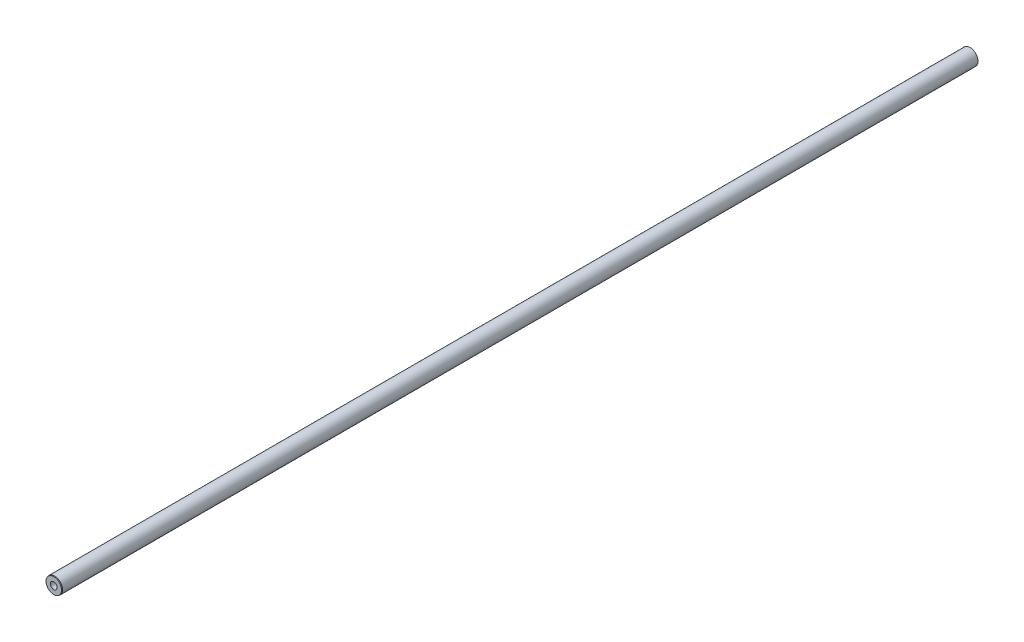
ISO-10303-21;
HEADER;
FILE_DESCRIPTION(('STEP AP214'),'2;1');
FILE_NAME('part.step','',(''),(''),'','','');
FILE_SCHEMA(('AUTOMOTIVE_DESIGN { 1 0 10303 214 1 1 1 1 }'));
ENDSEC;
DATA;
#1=APPLICATION_CONTEXT('core data for automotive mechanical design processes');
#2=APPLICATION_PROTOCOL_DEFINITION('international standard','automotive_design',2000,#1);
#3=PRODUCT_CONTEXT('',#1,'mechanical');
#4=PRODUCT('Part','Part','',(#3));
#5=PRODUCT_RELATED_PRODUCT_CATEGORY('part','',(#4));
#6=PRODUCT_DEFINITION_FORMATION('','',#4);
#7=PRODUCT_DEFINITION_CONTEXT('part definition',#1,'design');
#8=PRODUCT_DEFINITION('design','',#6,#7);
#9=PRODUCT_DEFINITION_SHAPE('','',#8);
#10=(LENGTH_UNIT() NAMED_UNIT(*) SI_UNIT(.MILLI.,.METRE.));
#11=(NAMED_UNIT(*) PLANE_ANGLE_UNIT() SI_UNIT($,.RADIAN.));
#12=(NAMED_UNIT(*) SI_UNIT($,.STERADIAN.) SOLID_ANGLE_UNIT());
#13=UNCERTAINTY_MEASURE_WITH_UNIT(LENGTH_MEASURE(1.E-05),#10,'distance_accuracy_value','');
#14=(GEOMETRIC_REPRESENTATION_CONTEXT(3) GLOBAL_UNCERTAINTY_ASSIGNED_CONTEXT((#13)) GLOBAL_UNIT_ASSIGNED_CONTEXT((#10,
#11,#12)) REPRESENTATION_CONTEXT('',''));
#15=CARTESIAN_POINT('',(0.,0.,0.));
#16=DIRECTION('',(0.,0.,1.));
#17=DIRECTION('',(1.,0.,0.));
#18=AXIS2_PLACEMENT_3D('',#15,#16,#17);
#19=CARTESIAN_POINT('',(0.,0.,619.252022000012));
#20=DIRECTION('',(0.,0.,1.));
#21=DIRECTION('',(1.,0.,0.));
#22=AXIS2_PLACEMENT_3D('',#19,#20,#21);
#23=CONICAL_SURFACE('',#22,5.35812535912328,1.02974425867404);
#24=CARTESIAN_POINT('',(-5.6843418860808E-11,0.,616.032535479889));
#25=VERTEX_POINT('',#24);
#26=VERTEX_LOOP('',#25);
#27=FACE_BOUND('',#26,.T.);
#28=CARTESIAN_POINT('',(0.,0.,619.252022));
#29=DIRECTION('',(0.,0.,1.));
#30=DIRECTION('',(1.,0.,0.));
#31=AXIS2_PLACEMENT_3D('',#28,#29,#30);
#32=CIRCLE('',#31,5.35812535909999);
#33=CARTESIAN_POINT('',(5.35812535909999,0.,619.252022));
#34=VERTEX_POINT('',#33);
#35=EDGE_CURVE('E52',#34,#34,#32,.T.);
#36=ORIENTED_EDGE('',*,*,#35,.T.);
#37=EDGE_LOOP('',(#36));
#38=FACE_BOUND('',#37,.T.);
#39=ADVANCED_FACE('F35',(#27,#38),#23,.F.);
#40=CARTESIAN_POINT('',(0.,0.,644.652));
#41=DIRECTION('',(0.,0.,1.));
#42=DIRECTION('',(1.,0.,0.));
#43=AXIS2_PLACEMENT_3D('',#40,#41,#42);
#44=CYLINDRICAL_SURFACE('',#43,5.35812535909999);
#45=CARTESIAN_POINT('',(0.,0.,644.652));
#46=DIRECTION('',(0.,0.,1.));
#47=DIRECTION('',(1.,0.,0.));
#48=AXIS2_PLACEMENT_3D('',#45,#46,#47);
#49=CIRCLE('',#48,5.35812535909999);
#50=CARTESIAN_POINT('',(5.35812535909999,0.,644.652));
#51=VERTEX_POINT('',#50);
#52=EDGE_CURVE('E38',#51,#51,#49,.F.);
#53=ORIENTED_EDGE('',*,*,#52,.F.);
#54=EDGE_LOOP('',(#53));
#55=FACE_BOUND('',#54,.T.);
#56=ORIENTED_EDGE('',*,*,#35,.F.);
#57=EDGE_LOOP('',(#56));
#58=FACE_BOUND('',#57,.T.);
#59=ADVANCED_FACE('F48',(#55,#58),#44,.F.);
#60=CARTESIAN_POINT('',(0.,0.,644.652));
#61=DIRECTION('',(0.,0.,1.));
#62=DIRECTION('',(1.,0.,0.));
#63=AXIS2_PLACEMENT_3D('',#60,#61,#62);
#64=PLANE('',#63);
#65=CARTESIAN_POINT('',(0.,0.,644.652));
#66=DIRECTION('',(0.,0.,-1.));
#67=DIRECTION('',(-1.,0.,0.));
#68=AXIS2_PLACEMENT_3D('',#65,#66,#67);
#69=CIRCLE('',#68,12.3597045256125);
#70=CARTESIAN_POINT('',(-12.3597045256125,0.,644.652));
#71=VERTEX_POINT('',#70);
#72=EDGE_CURVE('E42',#71,#71,#69,.T.);
#73=ORIENTED_EDGE('',*,*,#72,.F.);
#74=EDGE_LOOP('',(#73));
#75=FACE_BOUND('',#74,.T.);
#76=ORIENTED_EDGE('',*,*,#52,.T.);
#77=EDGE_LOOP('',(#76));
#78=FACE_BOUND('',#77,.T.);
#79=ADVANCED_FACE('F64',(#75,#78),#64,.T.);
#80=CARTESIAN_POINT('',(0.,0.,643.382));
#81=DIRECTION('',(0.,0.,-1.));
#82=DIRECTION('',(-1.,0.,0.));
#83=AXIS2_PLACEMENT_3D('',#80,#81,#82);
#84=CONICAL_SURFACE('',#83,12.7,0.261799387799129);
#85=CARTESIAN_POINT('',(0.,0.,643.382));
#86=DIRECTION('',(0.,0.,-1.));
#87=DIRECTION('',(-1.,0.,0.));
#88=AXIS2_PLACEMENT_3D('',#85,#86,#87);
#89=CIRCLE('',#88,12.7);
#90=CARTESIAN_POINT('',(-12.7,0.,643.382));
#91=VERTEX_POINT('',#90);
#92=EDGE_CURVE('E11',#91,#91,#89,.T.);
#93=ORIENTED_EDGE('',*,*,#92,.F.);
#94=EDGE_LOOP('',(#93));
#95=FACE_BOUND('',#94,.T.);
#96=ORIENTED_EDGE('',*,*,#72,.T.);
#97=EDGE_LOOP('',(#96));
#98=FACE_BOUND('',#97,.T.);
#99=ADVANCED_FACE('F62',(#95,#98),#84,.T.);
#100=CARTESIAN_POINT('',(0.,0.,644.652));
#101=DIRECTION('',(0.,0.,-1.));
#102=DIRECTION('',(-1.,0.,0.));
#103=AXIS2_PLACEMENT_3D('',#100,#101,#102);
#104=CYLINDRICAL_SURFACE('',#103,12.7);
#105=ORIENTED_EDGE('',*,*,#92,.T.);
#106=EDGE_LOOP('',(#105));
#107=FACE_BOUND('',#106,.T.);
#108=CARTESIAN_POINT('',(0.,0.,-812.8));
#109=DIRECTION('',(0.,0.,-1.));
#110=DIRECTION('',(-1.,0.,0.));
#111=AXIS2_PLACEMENT_3D('',#108,#109,#110);
#112=CIRCLE('',#111,12.7);
#113=CARTESIAN_POINT('',(-12.7,0.,-812.8));
#114=VERTEX_POINT('',#113);
#115=EDGE_CURVE('E54',#114,#114,#112,.T.);
#116=ORIENTED_EDGE('',*,*,#115,.F.);
#117=EDGE_LOOP('',(#116));
#118=FACE_BOUND('',#117,.T.);
#119=ADVANCED_FACE('F76',(#107,#118),#104,.T.);
#120=CARTESIAN_POINT('',(0.,0.,-812.8));
#121=DIRECTION('',(0.,0.,-1.));
#122=DIRECTION('',(-1.,0.,0.));
#123=AXIS2_PLACEMENT_3D('',#120,#121,#122);
#124=PLANE('',#123);
#125=ORIENTED_EDGE('',*,*,#115,.T.);
#126=EDGE_LOOP('',(#125));
#127=FACE_BOUND('',#126,.T.);
#128=ADVANCED_FACE('F49',(#127),#124,.T.);
#129=CLOSED_SHELL('',(#39,#59,#79,#99,#119,#128));
#130=MANIFOLD_SOLID_BREP('B2',#129);
#131=ADVANCED_BREP_SHAPE_REPRESENTATION('',(#18,#130),#14);
#132=SHAPE_DEFINITION_REPRESENTATION(#9,#131);
ENDSEC;
END-ISO-10303-21;
